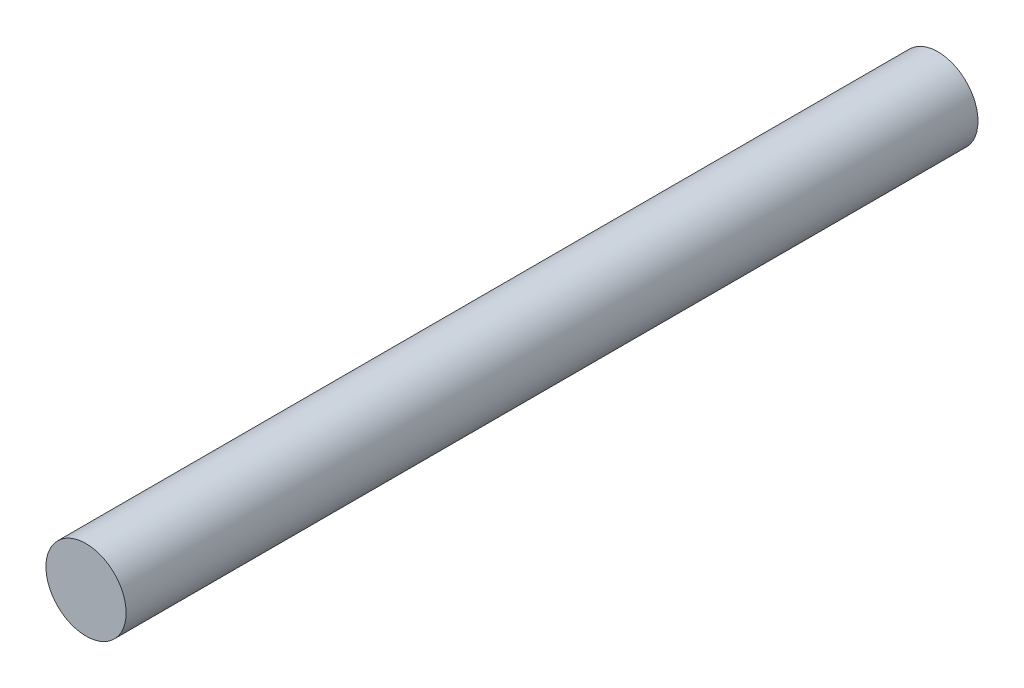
from build123d import *

# Parameters (mm, degrees)
ESQUISSE1_R          = 4
BASE_EXTRUSION_DEPTH = 85


with BuildPart() as part:
    # Esquisse1 → Base-Extrusion (new body)
    with BuildSketch(Plane.XY):
        with Locations((45, 0)):
            Circle(ESQUISSE1_R)
    extrude(amount=-BASE_EXTRUSION_DEPTH)


solid = part.part
